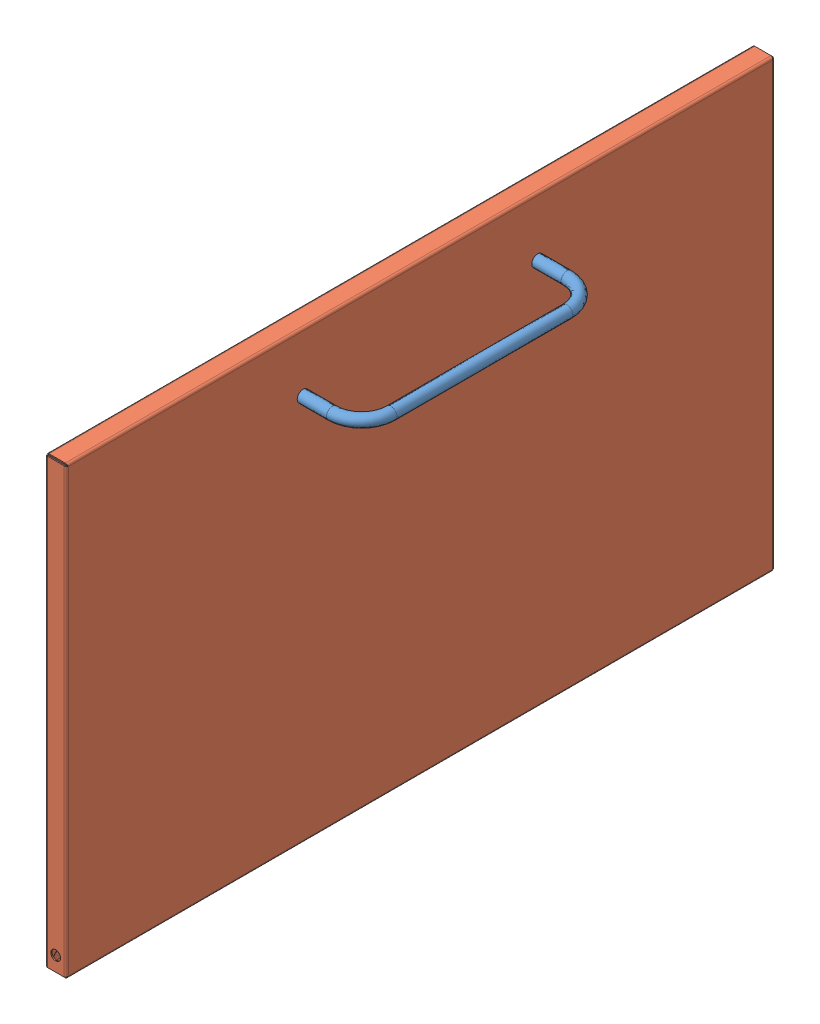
SolidWorks assembly Door Assembly.SLDASM, configuration Default (file format 10000). Lengths in mm.
Overall size (55.35 289.56 460.38).
2 component instances, 2 part files, 3 mates.
Components (placement in the parent):
- Handle, D-1: Handle, D.SLDPRT [Default] at (41.0718 -38.1 230.1875) x (0 0 -1) z (-1 0 0) size (160.02 7.62 41.91)
- Panel, Door-1: Panel, Door.SLDPRT [Default] at (2.2352 0 0) size (13.44 289.56 460.38)
Mates (geometry in assembly coordinates):
- Concentric1: concentric anti-aligned: circle of Panel, Door-1; circle of Handle, D-1
- Coincident1: coincident anti-aligned: plane of Panel, Door-1 through (2.9718 -289.56 460.375) normal (1 0 0); plane of Handle, D-1 through (2.9718 -38.1 306.3875) normal (-1 0 0)
- Concentric2: concentric anti-aligned: circle of Panel, Door-1; circle of Handle, D-1
